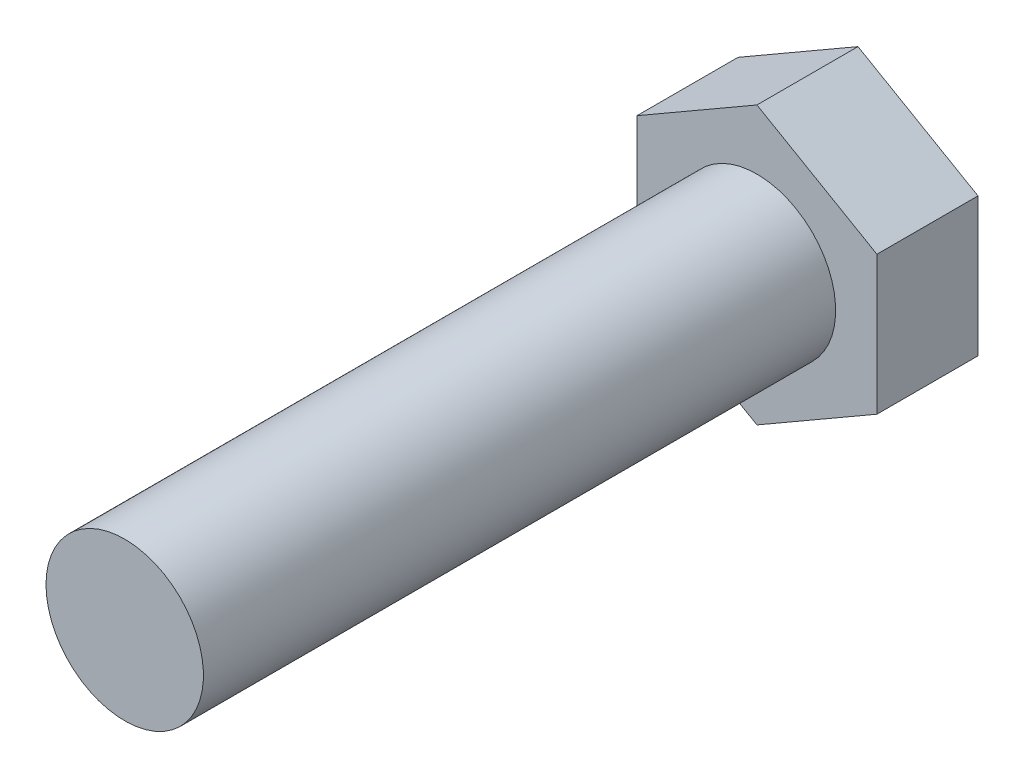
ISO-10303-21;
HEADER;
FILE_DESCRIPTION(('STEP AP214'),'2;1');
FILE_NAME('part.step','',(''),(''),'','','');
FILE_SCHEMA(('AUTOMOTIVE_DESIGN { 1 0 10303 214 1 1 1 1 }'));
ENDSEC;
DATA;
#1=APPLICATION_CONTEXT('core data for automotive mechanical design processes');
#2=APPLICATION_PROTOCOL_DEFINITION('international standard','automotive_design',2000,#1);
#3=PRODUCT_CONTEXT('',#1,'mechanical');
#4=PRODUCT('Part','Part','',(#3));
#5=PRODUCT_RELATED_PRODUCT_CATEGORY('part','',(#4));
#6=PRODUCT_DEFINITION_FORMATION('','',#4);
#7=PRODUCT_DEFINITION_CONTEXT('part definition',#1,'design');
#8=PRODUCT_DEFINITION('design','',#6,#7);
#9=PRODUCT_DEFINITION_SHAPE('','',#8);
#10=(LENGTH_UNIT() NAMED_UNIT(*) SI_UNIT(.MILLI.,.METRE.));
#11=(NAMED_UNIT(*) PLANE_ANGLE_UNIT() SI_UNIT($,.RADIAN.));
#12=(NAMED_UNIT(*) SI_UNIT($,.STERADIAN.) SOLID_ANGLE_UNIT());
#13=UNCERTAINTY_MEASURE_WITH_UNIT(LENGTH_MEASURE(1.E-05),#10,'distance_accuracy_value','');
#14=(GEOMETRIC_REPRESENTATION_CONTEXT(3) GLOBAL_UNCERTAINTY_ASSIGNED_CONTEXT((#13)) GLOBAL_UNIT_ASSIGNED_CONTEXT((#10,
#11,#12)) REPRESENTATION_CONTEXT('',''));
#15=CARTESIAN_POINT('',(0.,0.,0.));
#16=DIRECTION('',(0.,0.,1.));
#17=DIRECTION('',(1.,0.,0.));
#18=AXIS2_PLACEMENT_3D('',#15,#16,#17);
#19=CARTESIAN_POINT('',(-7.08660000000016,12.2743512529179,5.96899999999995));
#20=DIRECTION('',(0.,0.,0.99999999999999));
#21=DIRECTION('',(1.,0.,0.));
#22=AXIS2_PLACEMENT_3D('',#19,#20,#21);
#23=PLANE('',#22);
#24=DIRECTION('',(-0.866025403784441,0.500000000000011,0.));
#25=VECTOR('',#24,1.);
#26=CARTESIAN_POINT('',(7.08659999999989,4.09145041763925,5.969));
#27=LINE('',#26,#25);
#28=CARTESIAN_POINT('',(7.08659999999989,4.09145041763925,5.969));
#29=VERTEX_POINT('',#28);
#30=CARTESIAN_POINT('',(-2.91433543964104E-13,8.18290083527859,5.969));
#31=VERTEX_POINT('',#30);
#32=EDGE_CURVE('E115',#29,#31,#27,.T.);
#33=ORIENTED_EDGE('',*,*,#32,.T.);
#34=DIRECTION('',(-0.866025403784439,-0.500000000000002,0.));
#35=VECTOR('',#34,1.);
#36=CARTESIAN_POINT('',(-2.91433543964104E-13,8.18290083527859,5.969));
#37=LINE('',#36,#35);
#38=CARTESIAN_POINT('',(-7.08660000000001,4.09145041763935,5.96899999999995));
#39=VERTEX_POINT('',#38);
#40=EDGE_CURVE('E96',#31,#39,#37,.T.);
#41=ORIENTED_EDGE('',*,*,#40,.T.);
#42=DIRECTION('',(0.,-1.00000000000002,0.));
#43=VECTOR('',#42,1.);
#44=CARTESIAN_POINT('',(-7.08660000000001,4.09145041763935,5.96899999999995));
#45=LINE('',#44,#43);
#46=CARTESIAN_POINT('',(-7.0866,-4.09145041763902,5.969));
#47=VERTEX_POINT('',#46);
#48=EDGE_CURVE('E118',#39,#47,#45,.T.);
#49=ORIENTED_EDGE('',*,*,#48,.T.);
#50=DIRECTION('',(0.866025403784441,-0.500000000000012,0.));
#51=VECTOR('',#50,1.);
#52=CARTESIAN_POINT('',(-7.0866,-4.09145041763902,5.969));
#53=LINE('',#52,#51);
#54=CARTESIAN_POINT('',(0.,-8.18290083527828,5.969));
#55=VERTEX_POINT('',#54);
#56=EDGE_CURVE('E120',#47,#55,#53,.T.);
#57=ORIENTED_EDGE('',*,*,#56,.T.);
#58=DIRECTION('',(0.866025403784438,0.500000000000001,0.));
#59=VECTOR('',#58,1.);
#60=CARTESIAN_POINT('',(0.,-8.18290083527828,5.969));
#61=LINE('',#60,#59);
#62=CARTESIAN_POINT('',(7.08659999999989,-4.09145041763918,5.969));
#63=VERTEX_POINT('',#62);
#64=EDGE_CURVE('E50',#55,#63,#61,.T.);
#65=ORIENTED_EDGE('',*,*,#64,.T.);
#66=DIRECTION('',(0.,1.00000000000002,0.));
#67=VECTOR('',#66,1.);
#68=CARTESIAN_POINT('',(7.08659999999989,-4.09145041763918,5.969));
#69=LINE('',#68,#67);
#70=EDGE_CURVE('E45',#63,#29,#69,.T.);
#71=ORIENTED_EDGE('',*,*,#70,.T.);
#72=EDGE_LOOP('',(#33,#41,#49,#57,#65,#71));
#73=FACE_BOUND('',#72,.T.);
#74=CARTESIAN_POINT('',(-1.2490009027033E-13,0.,5.96899999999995));
#75=DIRECTION('',(0.,0.,0.99999999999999));
#76=DIRECTION('',(1.,0.,0.));
#77=AXIS2_PLACEMENT_3D('',#74,#75,#76);
#78=CIRCLE('',#77,4.6482);
#79=CARTESIAN_POINT('',(-4.64820000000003,0.,5.96899999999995));
#80=VERTEX_POINT('',#79);
#81=EDGE_CURVE('E104',#80,#80,#78,.T.);
#82=ORIENTED_EDGE('',*,*,#81,.F.);
#83=EDGE_LOOP('',(#82));
#84=FACE_BOUND('',#83,.T.);
#85=ADVANCED_FACE('F30',(#73,#84),#23,.T.);
#86=CARTESIAN_POINT('',(7.08659999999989,4.09145041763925,5.969));
#87=DIRECTION('',(-0.499999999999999,-0.866025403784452,0.));
#88=DIRECTION('',(0.866025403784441,-0.500000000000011,0.));
#89=AXIS2_PLACEMENT_3D('',#86,#87,#88);
#90=PLANE('',#89);
#91=DIRECTION('',(-0.866025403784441,0.500000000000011,0.));
#92=VECTOR('',#91,1.);
#93=CARTESIAN_POINT('',(7.08660000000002,4.09145041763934,0.));
#94=LINE('',#93,#92);
#95=CARTESIAN_POINT('',(7.08660000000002,4.09145041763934,0.));
#96=VERTEX_POINT('',#95);
#97=CARTESIAN_POINT('',(0.,8.18290083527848,0.));
#98=VERTEX_POINT('',#97);
#99=EDGE_CURVE('E87',#96,#98,#94,.T.);
#100=ORIENTED_EDGE('',*,*,#99,.T.);
#101=DIRECTION('',(0.,0.,-0.99999999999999));
#102=VECTOR('',#101,1.);
#103=CARTESIAN_POINT('',(-2.91433543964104E-13,8.18290083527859,5.969));
#104=LINE('',#103,#102);
#105=EDGE_CURVE('E11',#31,#98,#104,.T.);
#106=ORIENTED_EDGE('',*,*,#105,.F.);
#107=ORIENTED_EDGE('',*,*,#32,.F.);
#108=DIRECTION('',(0.,0.,-0.99999999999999));
#109=VECTOR('',#108,1.);
#110=CARTESIAN_POINT('',(7.08659999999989,4.09145041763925,5.969));
#111=LINE('',#110,#109);
#112=EDGE_CURVE('E100',#29,#96,#111,.T.);
#113=ORIENTED_EDGE('',*,*,#112,.T.);
#114=EDGE_LOOP('',(#100,#106,#107,#113));
#115=FACE_BOUND('',#114,.T.);
#116=ADVANCED_FACE('F32',(#115),#90,.F.);
#117=CARTESIAN_POINT('',(-2.91433543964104E-13,8.18290083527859,5.969));
#118=DIRECTION('',(0.500000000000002,-0.866025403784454,0.));
#119=DIRECTION('',(0.866025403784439,0.500000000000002,0.));
#120=AXIS2_PLACEMENT_3D('',#117,#118,#119);
#121=PLANE('',#120);
#122=DIRECTION('',(-0.866025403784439,-0.500000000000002,0.));
#123=VECTOR('',#122,1.);
#124=CARTESIAN_POINT('',(0.,8.18290083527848,0.));
#125=LINE('',#124,#123);
#126=CARTESIAN_POINT('',(-7.08660000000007,4.09145041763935,0.));
#127=VERTEX_POINT('',#126);
#128=EDGE_CURVE('E83',#98,#127,#125,.T.);
#129=ORIENTED_EDGE('',*,*,#128,.T.);
#130=DIRECTION('',(0.,0.,-0.99999999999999));
#131=VECTOR('',#130,1.);
#132=CARTESIAN_POINT('',(-7.08660000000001,4.09145041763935,5.96899999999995));
#133=LINE('',#132,#131);
#134=EDGE_CURVE('E38',#39,#127,#133,.T.);
#135=ORIENTED_EDGE('',*,*,#134,.F.);
#136=ORIENTED_EDGE('',*,*,#40,.F.);
#137=ORIENTED_EDGE('',*,*,#105,.T.);
#138=EDGE_LOOP('',(#129,#135,#136,#137));
#139=FACE_BOUND('',#138,.T.);
#140=ADVANCED_FACE('F95',(#139),#121,.F.);
#141=CARTESIAN_POINT('',(-7.08660000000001,4.09145041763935,5.96899999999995));
#142=DIRECTION('',(1.,0.,0.));
#143=DIRECTION('',(0.,0.,-0.99999999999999));
#144=AXIS2_PLACEMENT_3D('',#141,#142,#143);
#145=PLANE('',#144);
#146=DIRECTION('',(0.,-1.00000000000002,0.));
#147=VECTOR('',#146,1.);
#148=CARTESIAN_POINT('',(-7.08660000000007,4.09145041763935,0.));
#149=LINE('',#148,#147);
#150=CARTESIAN_POINT('',(-7.08659999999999,-4.09145041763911,0.));
#151=VERTEX_POINT('',#150);
#152=EDGE_CURVE('E89',#127,#151,#149,.T.);
#153=ORIENTED_EDGE('',*,*,#152,.T.);
#154=DIRECTION('',(0.,0.,-0.99999999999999));
#155=VECTOR('',#154,1.);
#156=CARTESIAN_POINT('',(-7.0866,-4.09145041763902,5.969));
#157=LINE('',#156,#155);
#158=EDGE_CURVE('E131',#47,#151,#157,.T.);
#159=ORIENTED_EDGE('',*,*,#158,.F.);
#160=ORIENTED_EDGE('',*,*,#48,.F.);
#161=ORIENTED_EDGE('',*,*,#134,.T.);
#162=EDGE_LOOP('',(#153,#159,#160,#161));
#163=FACE_BOUND('',#162,.T.);
#164=ADVANCED_FACE('F135',(#163),#145,.F.);
#165=CARTESIAN_POINT('',(-7.0866,-4.09145041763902,5.969));
#166=DIRECTION('',(0.500000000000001,0.866025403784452,0.));
#167=DIRECTION('',(-0.866025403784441,0.500000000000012,0.));
#168=AXIS2_PLACEMENT_3D('',#165,#166,#167);
#169=PLANE('',#168);
#170=DIRECTION('',(0.866025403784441,-0.500000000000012,0.));
#171=VECTOR('',#170,1.);
#172=CARTESIAN_POINT('',(-7.08659999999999,-4.09145041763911,0.));
#173=LINE('',#172,#171);
#174=CARTESIAN_POINT('',(0.,-8.18290083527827,0.));
#175=VERTEX_POINT('',#174);
#176=EDGE_CURVE('E109',#151,#175,#173,.T.);
#177=ORIENTED_EDGE('',*,*,#176,.T.);
#178=DIRECTION('',(0.,0.,-0.99999999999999));
#179=VECTOR('',#178,1.);
#180=CARTESIAN_POINT('',(0.,-8.18290083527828,5.969));
#181=LINE('',#180,#179);
#182=EDGE_CURVE('E128',#55,#175,#181,.T.);
#183=ORIENTED_EDGE('',*,*,#182,.F.);
#184=ORIENTED_EDGE('',*,*,#56,.F.);
#185=ORIENTED_EDGE('',*,*,#158,.T.);
#186=EDGE_LOOP('',(#177,#183,#184,#185));
#187=FACE_BOUND('',#186,.T.);
#188=ADVANCED_FACE('F141',(#187),#169,.F.);
#189=CARTESIAN_POINT('',(0.,-8.18290083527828,5.969));
#190=DIRECTION('',(-0.500000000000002,0.866025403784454,0.));
#191=DIRECTION('',(-0.866025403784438,-0.500000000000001,0.));
#192=AXIS2_PLACEMENT_3D('',#189,#190,#191);
#193=PLANE('',#192);
#194=DIRECTION('',(0.866025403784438,0.500000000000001,0.));
#195=VECTOR('',#194,1.);
#196=CARTESIAN_POINT('',(0.,-8.18290083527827,0.));
#197=LINE('',#196,#195);
#198=CARTESIAN_POINT('',(7.08660000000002,-4.09145041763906,0.));
#199=VERTEX_POINT('',#198);
#200=EDGE_CURVE('E111',#175,#199,#197,.T.);
#201=ORIENTED_EDGE('',*,*,#200,.T.);
#202=DIRECTION('',(0.,0.,-0.99999999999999));
#203=VECTOR('',#202,1.);
#204=CARTESIAN_POINT('',(7.08659999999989,-4.09145041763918,5.969));
#205=LINE('',#204,#203);
#206=EDGE_CURVE('E125',#63,#199,#205,.T.);
#207=ORIENTED_EDGE('',*,*,#206,.F.);
#208=ORIENTED_EDGE('',*,*,#64,.F.);
#209=ORIENTED_EDGE('',*,*,#182,.T.);
#210=EDGE_LOOP('',(#201,#207,#208,#209));
#211=FACE_BOUND('',#210,.T.);
#212=ADVANCED_FACE('F144',(#211),#193,.F.);
#213=CARTESIAN_POINT('',(7.08659999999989,-4.09145041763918,5.969));
#214=DIRECTION('',(-1.,0.,0.));
#215=DIRECTION('',(0.,0.,0.99999999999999));
#216=AXIS2_PLACEMENT_3D('',#213,#214,#215);
#217=PLANE('',#216);
#218=DIRECTION('',(0.,1.00000000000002,0.));
#219=VECTOR('',#218,1.);
#220=CARTESIAN_POINT('',(7.08660000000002,-4.09145041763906,0.));
#221=LINE('',#220,#219);
#222=EDGE_CURVE('E113',#199,#96,#221,.T.);
#223=ORIENTED_EDGE('',*,*,#222,.T.);
#224=ORIENTED_EDGE('',*,*,#112,.F.);
#225=ORIENTED_EDGE('',*,*,#70,.F.);
#226=ORIENTED_EDGE('',*,*,#206,.T.);
#227=EDGE_LOOP('',(#223,#224,#225,#226));
#228=FACE_BOUND('',#227,.T.);
#229=ADVANCED_FACE('F146',(#228),#217,.F.);
#230=CARTESIAN_POINT('',(-7.08660000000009,12.274351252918,0.));
#231=DIRECTION('',(0.,0.,0.99999999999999));
#232=DIRECTION('',(1.,0.,0.));
#233=AXIS2_PLACEMENT_3D('',#230,#231,#232);
#234=PLANE('',#233);
#235=ORIENTED_EDGE('',*,*,#99,.F.);
#236=ORIENTED_EDGE('',*,*,#222,.F.);
#237=ORIENTED_EDGE('',*,*,#200,.F.);
#238=ORIENTED_EDGE('',*,*,#176,.F.);
#239=ORIENTED_EDGE('',*,*,#152,.F.);
#240=ORIENTED_EDGE('',*,*,#128,.F.);
#241=EDGE_LOOP('',(#235,#236,#237,#238,#239,#240));
#242=FACE_BOUND('',#241,.T.);
#243=ADVANCED_FACE('F84',(#242),#234,.F.);
#244=CARTESIAN_POINT('',(0.,0.,43.3069999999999));
#245=DIRECTION('',(0.,0.,-0.99999999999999));
#246=DIRECTION('',(-1.,0.,0.));
#247=AXIS2_PLACEMENT_3D('',#244,#245,#246);
#248=CYLINDRICAL_SURFACE('',#247,4.6482);
#249=CARTESIAN_POINT('',(0.,0.,43.3069999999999));
#250=DIRECTION('',(0.,0.,0.99999999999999));
#251=DIRECTION('',(1.,0.,0.));
#252=AXIS2_PLACEMENT_3D('',#249,#250,#251);
#253=CIRCLE('',#252,4.6482);
#254=CARTESIAN_POINT('',(-4.64820000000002,0.,43.3069999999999));
#255=VERTEX_POINT('',#254);
#256=EDGE_CURVE('E101',#255,#255,#253,.T.);
#257=CARTESIAN_POINT('',(-4.64820000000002,0.,43.3069999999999));
#258=CARTESIAN_POINT('',(-4.64820000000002,0.,42.9180624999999));
#259=CARTESIAN_POINT('',(-4.64820000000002,0.,42.5291249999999));
#260=CARTESIAN_POINT('',(-4.64820000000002,0.,41.7512499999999));
#261=CARTESIAN_POINT('',(-4.64820000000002,0.,41.3623124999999));
#262=CARTESIAN_POINT('',(-4.64820000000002,0.,40.5844374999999));
#263=CARTESIAN_POINT('',(-4.64820000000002,0.,40.1954999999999));
#264=CARTESIAN_POINT('',(-4.64820000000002,0.,39.4176249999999));
#265=CARTESIAN_POINT('',(-4.64820000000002,0.,39.0286874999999));
#266=CARTESIAN_POINT('',(-4.64820000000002,0.,38.2508124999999));
#267=CARTESIAN_POINT('',(-4.64820000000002,0.,37.8618749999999));
#268=CARTESIAN_POINT('',(-4.64820000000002,0.,37.0839999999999));
#269=CARTESIAN_POINT('',(-4.64820000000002,0.,36.6950624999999));
#270=CARTESIAN_POINT('',(-4.64820000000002,0.,35.9171874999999));
#271=CARTESIAN_POINT('',(-4.64820000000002,0.,35.5282499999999));
#272=CARTESIAN_POINT('',(-4.64820000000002,0.,34.7503749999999));
#273=CARTESIAN_POINT('',(-4.64820000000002,0.,34.3614374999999));
#274=CARTESIAN_POINT('',(-4.64820000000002,0.,33.5835624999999));
#275=CARTESIAN_POINT('',(-4.64820000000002,0.,33.1946249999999));
#276=CARTESIAN_POINT('',(-4.64820000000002,0.,32.4167499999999));
#277=CARTESIAN_POINT('',(-4.64820000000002,0.,32.0278124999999));
#278=CARTESIAN_POINT('',(-4.64820000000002,0.,31.2499374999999));
#279=CARTESIAN_POINT('',(-4.64820000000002,0.,30.8609999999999));
#280=CARTESIAN_POINT('',(-4.64820000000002,0.,30.0831249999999));
#281=CARTESIAN_POINT('',(-4.64820000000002,0.,29.6941874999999));
#282=CARTESIAN_POINT('',(-4.64820000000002,0.,28.9163124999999));
#283=CARTESIAN_POINT('',(-4.64820000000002,0.,28.5273749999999));
#284=CARTESIAN_POINT('',(-4.64820000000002,0.,27.7494999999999));
#285=CARTESIAN_POINT('',(-4.64820000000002,0.,27.3605624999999));
#286=CARTESIAN_POINT('',(-4.64820000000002,0.,26.5826874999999));
#287=CARTESIAN_POINT('',(-4.64820000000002,0.,26.1937499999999));
#288=CARTESIAN_POINT('',(-4.64820000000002,0.,25.4158749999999));
#289=CARTESIAN_POINT('',(-4.64820000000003,0.,25.0269374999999));
#290=CARTESIAN_POINT('',(-4.64820000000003,0.,24.2490624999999));
#291=CARTESIAN_POINT('',(-4.64820000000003,0.,23.8601249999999));
#292=CARTESIAN_POINT('',(-4.64820000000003,0.,23.0822499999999));
#293=CARTESIAN_POINT('',(-4.64820000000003,0.,22.6933124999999));
#294=CARTESIAN_POINT('',(-4.64820000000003,0.,21.9154374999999));
#295=CARTESIAN_POINT('',(-4.64820000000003,0.,21.5264999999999));
#296=CARTESIAN_POINT('',(-4.64820000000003,0.,20.7486249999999));
#297=CARTESIAN_POINT('',(-4.64820000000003,0.,20.3596874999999));
#298=CARTESIAN_POINT('',(-4.64820000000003,0.,19.5818124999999));
#299=CARTESIAN_POINT('',(-4.64820000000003,0.,19.1928749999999));
#300=CARTESIAN_POINT('',(-4.64820000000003,0.,18.4149999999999));
#301=CARTESIAN_POINT('',(-4.64820000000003,0.,18.0260624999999));
#302=CARTESIAN_POINT('',(-4.64820000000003,0.,17.2481875));
#303=CARTESIAN_POINT('',(-4.64820000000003,0.,16.8592499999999));
#304=CARTESIAN_POINT('',(-4.64820000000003,0.,16.081375));
#305=CARTESIAN_POINT('',(-4.64820000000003,0.,15.6924374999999));
#306=CARTESIAN_POINT('',(-4.64820000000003,0.,14.9145624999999));
#307=CARTESIAN_POINT('',(-4.64820000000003,0.,14.5256249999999));
#308=CARTESIAN_POINT('',(-4.64820000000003,0.,13.7477499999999));
#309=CARTESIAN_POINT('',(-4.64820000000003,0.,13.3588124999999));
#310=CARTESIAN_POINT('',(-4.64820000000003,0.,12.5809374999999));
#311=CARTESIAN_POINT('',(-4.64820000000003,0.,12.1919999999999));
#312=CARTESIAN_POINT('',(-4.64820000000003,0.,11.4141249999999));
#313=CARTESIAN_POINT('',(-4.64820000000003,0.,11.0251874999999));
#314=CARTESIAN_POINT('',(-4.64820000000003,0.,10.2473125));
#315=CARTESIAN_POINT('',(-4.64820000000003,0.,9.85837499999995));
#316=CARTESIAN_POINT('',(-4.64820000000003,0.,9.08049999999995));
#317=CARTESIAN_POINT('',(-4.64820000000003,0.,8.69156249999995));
#318=CARTESIAN_POINT('',(-4.64820000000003,0.,7.91368749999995));
#319=CARTESIAN_POINT('',(-4.64820000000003,0.,7.52474999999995));
#320=CARTESIAN_POINT('',(-4.64820000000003,0.,6.74687499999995));
#321=CARTESIAN_POINT('',(-4.64820000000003,0.,6.35793749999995));
#322=CARTESIAN_POINT('',(-4.64820000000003,0.,5.96899999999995));
#323=B_SPLINE_CURVE_WITH_KNOTS('',3,(#257,#258,#259,#260,#261,#262,#263,#264,#265,#266,#267,
#268,#269,#270,#271,#272,#273,#274,#275,#276,#277,#278,#279,#280,#281,#282,#283,#284,#285,#286,
#287,#288,#289,#290,#291,#292,#293,#294,#295,#296,#297,#298,#299,#300,#301,#302,#303,#304,#305,
#306,#307,#308,#309,#310,#311,#312,#313,#314,#315,#316,#317,#318,#319,#320,#321,#322),
.UNSPECIFIED.,.F.,.F.,(4,2,2,2,2,2,2,2,2,2,2,2,2,2,2,2,2,2,2,2,2,2,2,2,2,2,2,2,2,2,2,2,4),(0.,
1.1668125,2.333625,3.5004375,4.66725,5.8340625,7.000875,8.1676875,9.3345,10.5013125,11.668125,
12.8349375,14.00175,15.1685625,16.335375,17.5021875,18.669,19.8358125,21.002625,22.1694375,
23.33625,24.5030625,25.669875,26.8366875,28.0035,29.1703125,30.337125,31.5039375,32.67075,
33.8375625,35.004375,36.1711875,37.338),.UNSPECIFIED.);
#324=EDGE_CURVE('BSEAM153',#255,#80,#323,.T.);
#325=ORIENTED_EDGE('',*,*,#256,.F.);
#326=ORIENTED_EDGE('',*,*,#81,.T.);
#327=ORIENTED_EDGE('',*,*,#324,.T.);
#328=ORIENTED_EDGE('',*,*,#324,.F.);
#329=EDGE_LOOP('',(#325,#327,#326,#328));
#330=FACE_BOUND('',#329,.T.);
#331=ADVANCED_FACE('F153',(#330),#248,.T.);
#332=CARTESIAN_POINT('',(0.,0.,43.3069999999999));
#333=DIRECTION('',(0.,0.,0.99999999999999));
#334=DIRECTION('',(1.,0.,0.));
#335=AXIS2_PLACEMENT_3D('',#332,#333,#334);
#336=PLANE('',#335);
#337=ORIENTED_EDGE('',*,*,#256,.T.);
#338=EDGE_LOOP('',(#337));
#339=FACE_BOUND('',#338,.T.);
#340=ADVANCED_FACE('F164',(#339),#336,.T.);
#341=CLOSED_SHELL('',(#85,#116,#140,#164,#188,#212,#229,#243,#331,#340));
#342=MANIFOLD_SOLID_BREP('B2',#341);
#343=ADVANCED_BREP_SHAPE_REPRESENTATION('',(#18,#342),#14);
#344=SHAPE_DEFINITION_REPRESENTATION(#9,#343);
ENDSEC;
END-ISO-10303-21;
